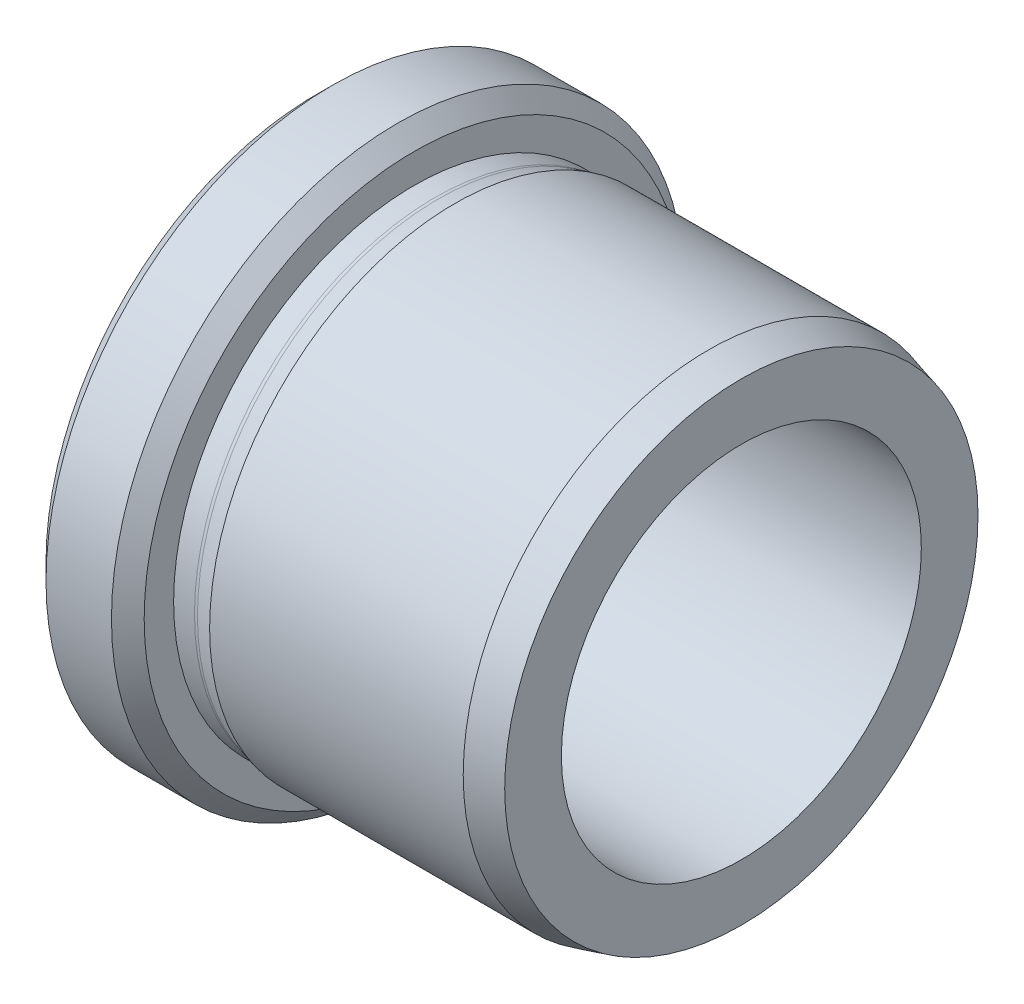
ISO-10303-21;
HEADER;
FILE_DESCRIPTION(('STEP AP214'),'2;1');
FILE_NAME('part.step','',(''),(''),'','','');
FILE_SCHEMA(('AUTOMOTIVE_DESIGN { 1 0 10303 214 1 1 1 1 }'));
ENDSEC;
DATA;
#1=APPLICATION_CONTEXT('core data for automotive mechanical design processes');
#2=APPLICATION_PROTOCOL_DEFINITION('international standard','automotive_design',2000,#1);
#3=PRODUCT_CONTEXT('',#1,'mechanical');
#4=PRODUCT('Part','Part','',(#3));
#5=PRODUCT_RELATED_PRODUCT_CATEGORY('part','',(#4));
#6=PRODUCT_DEFINITION_FORMATION('','',#4);
#7=PRODUCT_DEFINITION_CONTEXT('part definition',#1,'design');
#8=PRODUCT_DEFINITION('design','',#6,#7);
#9=PRODUCT_DEFINITION_SHAPE('','',#8);
#10=(LENGTH_UNIT() NAMED_UNIT(*) SI_UNIT(.MILLI.,.METRE.));
#11=(NAMED_UNIT(*) PLANE_ANGLE_UNIT() SI_UNIT($,.RADIAN.));
#12=(NAMED_UNIT(*) SI_UNIT($,.STERADIAN.) SOLID_ANGLE_UNIT());
#13=UNCERTAINTY_MEASURE_WITH_UNIT(LENGTH_MEASURE(1.E-05),#10,'distance_accuracy_value','');
#14=(GEOMETRIC_REPRESENTATION_CONTEXT(3) GLOBAL_UNCERTAINTY_ASSIGNED_CONTEXT((#13)) GLOBAL_UNIT_ASSIGNED_CONTEXT((#10,
#11,#12)) REPRESENTATION_CONTEXT('',''));
#15=CARTESIAN_POINT('',(0.,0.,0.));
#16=DIRECTION('',(0.,0.,1.));
#17=DIRECTION('',(1.,0.,0.));
#18=AXIS2_PLACEMENT_3D('',#15,#16,#17);
#19=CARTESIAN_POINT('',(18.075539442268,0.,0.));
#20=DIRECTION('',(-1.,0.,0.));
#21=DIRECTION('',(0.,0.,1.));
#22=AXIS2_PLACEMENT_3D('',#19,#20,#21);
#23=TOROIDAL_SURFACE('',#22,15.5,0.8);
#24=CARTESIAN_POINT('',(18.075539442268,0.,0.));
#25=DIRECTION('',(-1.,0.,0.));
#26=DIRECTION('',(0.,0.,1.));
#27=AXIS2_PLACEMENT_3D('',#24,#25,#26);
#28=CIRCLE('',#27,14.7);
#29=CARTESIAN_POINT('',(18.075539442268,0.,14.7));
#30=VERTEX_POINT('',#29);
#31=EDGE_CURVE('E58',#30,#30,#28,.T.);
#32=ORIENTED_EDGE('',*,*,#31,.F.);
#33=EDGE_LOOP('',(#32));
#34=FACE_BOUND('',#33,.T.);
#35=CARTESIAN_POINT('',(18.28259467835,0.,0.));
#36=DIRECTION('',(-1.,0.,0.));
#37=DIRECTION('',(0.,0.,1.));
#38=AXIS2_PLACEMENT_3D('',#35,#36,#37);
#39=CIRCLE('',#38,14.7272593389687);
#40=CARTESIAN_POINT('',(18.28259467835,0.,14.7272593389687));
#41=VERTEX_POINT('',#40);
#42=EDGE_CURVE('E40',#41,#41,#39,.T.);
#43=ORIENTED_EDGE('',*,*,#42,.T.);
#44=EDGE_LOOP('',(#43));
#45=FACE_BOUND('',#44,.T.);
#46=ADVANCED_FACE('F14',(#34,#45),#23,.F.);
#47=CARTESIAN_POINT('',(19.3004766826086,0.,0.));
#48=DIRECTION('',(1.,0.,0.));
#49=DIRECTION('',(0.,0.,-1.));
#50=AXIS2_PLACEMENT_3D('',#47,#48,#49);
#51=CONICAL_SURFACE('',#50,15.,0.261799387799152);
#52=ORIENTED_EDGE('',*,*,#42,.F.);
#53=EDGE_LOOP('',(#52));
#54=FACE_BOUND('',#53,.T.);
#55=CARTESIAN_POINT('',(19.3004766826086,0.,0.));
#56=DIRECTION('',(-1.,0.,0.));
#57=DIRECTION('',(0.,0.,1.));
#58=AXIS2_PLACEMENT_3D('',#55,#56,#57);
#59=CIRCLE('',#58,15.);
#60=CARTESIAN_POINT('',(19.3004766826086,0.,15.));
#61=VERTEX_POINT('',#60);
#62=EDGE_CURVE('E43',#61,#61,#59,.T.);
#63=ORIENTED_EDGE('',*,*,#62,.T.);
#64=EDGE_LOOP('',(#63));
#65=FACE_BOUND('',#64,.T.);
#66=ADVANCED_FACE('F66',(#54,#65),#51,.T.);
#67=CARTESIAN_POINT('',(0.,0.,0.));
#68=DIRECTION('',(-1.,0.,0.));
#69=DIRECTION('',(0.,0.,1.));
#70=AXIS2_PLACEMENT_3D('',#67,#68,#69);
#71=CYLINDRICAL_SURFACE('',#70,15.);
#72=ORIENTED_EDGE('',*,*,#62,.F.);
#73=EDGE_LOOP('',(#72));
#74=FACE_BOUND('',#73,.T.);
#75=CARTESIAN_POINT('',(34.8004766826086,0.,0.));
#76=DIRECTION('',(-1.,0.,0.));
#77=DIRECTION('',(0.,0.,1.));
#78=AXIS2_PLACEMENT_3D('',#75,#76,#77);
#79=CIRCLE('',#78,15.);
#80=CARTESIAN_POINT('',(34.8004766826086,0.,15.));
#81=VERTEX_POINT('',#80);
#82=EDGE_CURVE('E46',#81,#81,#79,.T.);
#83=ORIENTED_EDGE('',*,*,#82,.T.);
#84=EDGE_LOOP('',(#83));
#85=FACE_BOUND('',#84,.T.);
#86=ADVANCED_FACE('F72',(#74,#85),#71,.T.);
#87=CARTESIAN_POINT('',(36.8004766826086,0.,0.));
#88=DIRECTION('',(-1.,0.,0.));
#89=DIRECTION('',(0.,0.,1.));
#90=AXIS2_PLACEMENT_3D('',#87,#88,#89);
#91=CONICAL_SURFACE('',#90,14.4641016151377,0.26179938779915);
#92=ORIENTED_EDGE('',*,*,#82,.F.);
#93=EDGE_LOOP('',(#92));
#94=FACE_BOUND('',#93,.T.);
#95=CARTESIAN_POINT('',(36.8004766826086,0.,0.));
#96=DIRECTION('',(-1.,0.,0.));
#97=DIRECTION('',(0.,0.,1.));
#98=AXIS2_PLACEMENT_3D('',#95,#96,#97);
#99=CIRCLE('',#98,14.4641016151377);
#100=CARTESIAN_POINT('',(36.8004766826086,0.,14.4641016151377));
#101=VERTEX_POINT('',#100);
#102=EDGE_CURVE('E49',#101,#101,#99,.T.);
#103=ORIENTED_EDGE('',*,*,#102,.T.);
#104=EDGE_LOOP('',(#103));
#105=FACE_BOUND('',#104,.T.);
#106=ADVANCED_FACE('F78',(#94,#105),#91,.T.);
#107=CARTESIAN_POINT('',(36.8004766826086,14.4641016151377,0.));
#108=DIRECTION('',(-1.,0.,0.));
#109=DIRECTION('',(0.,0.,1.));
#110=AXIS2_PLACEMENT_3D('',#107,#108,#109);
#111=PLANE('',#110);
#112=ORIENTED_EDGE('',*,*,#102,.F.);
#113=EDGE_LOOP('',(#112));
#114=FACE_BOUND('',#113,.T.);
#115=CARTESIAN_POINT('',(36.8004766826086,0.,0.));
#116=DIRECTION('',(-1.,0.,0.));
#117=DIRECTION('',(0.,0.,1.));
#118=AXIS2_PLACEMENT_3D('',#115,#116,#117);
#119=CIRCLE('',#118,11.);
#120=CARTESIAN_POINT('',(36.8004766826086,0.,11.));
#121=VERTEX_POINT('',#120);
#122=EDGE_CURVE('E52',#121,#121,#119,.T.);
#123=ORIENTED_EDGE('',*,*,#122,.T.);
#124=EDGE_LOOP('',(#123));
#125=FACE_BOUND('',#124,.T.);
#126=ADVANCED_FACE('F84',(#114,#125),#111,.F.);
#127=CARTESIAN_POINT('',(0.,0.,0.));
#128=DIRECTION('',(-1.,0.,0.));
#129=DIRECTION('',(0.,0.,1.));
#130=AXIS2_PLACEMENT_3D('',#127,#128,#129);
#131=CYLINDRICAL_SURFACE('',#130,11.);
#132=CARTESIAN_POINT('',(12.3004766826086,0.,0.));
#133=DIRECTION('',(1.,0.,0.));
#134=DIRECTION('',(0.,0.,-1.));
#135=AXIS2_PLACEMENT_3D('',#132,#133,#134);
#136=CIRCLE('',#135,11.);
#137=CARTESIAN_POINT('',(12.3004766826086,0.,-11.));
#138=VERTEX_POINT('',#137);
#139=EDGE_CURVE('E29',#138,#138,#136,.F.);
#140=ORIENTED_EDGE('',*,*,#139,.T.);
#141=EDGE_LOOP('',(#140));
#142=FACE_BOUND('',#141,.T.);
#143=ORIENTED_EDGE('',*,*,#122,.F.);
#144=EDGE_LOOP('',(#143));
#145=FACE_BOUND('',#144,.T.);
#146=ADVANCED_FACE('F90',(#142,#145),#131,.F.);
#147=CARTESIAN_POINT('',(10.8004766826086,17.5,0.));
#148=DIRECTION('',(1.,0.,0.));
#149=DIRECTION('',(0.,0.,-1.));
#150=AXIS2_PLACEMENT_3D('',#147,#148,#149);
#151=PLANE('',#150);
#152=CARTESIAN_POINT('',(10.8004766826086,0.,0.));
#153=DIRECTION('',(1.,0.,0.));
#154=DIRECTION('',(0.,0.,-1.));
#155=AXIS2_PLACEMENT_3D('',#152,#153,#154);
#156=CIRCLE('',#155,12.5);
#157=CARTESIAN_POINT('',(10.8004766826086,0.,-12.5));
#158=VERTEX_POINT('',#157);
#159=EDGE_CURVE('E25',#158,#158,#156,.T.);
#160=ORIENTED_EDGE('',*,*,#159,.T.);
#161=EDGE_LOOP('',(#160));
#162=FACE_BOUND('',#161,.T.);
#163=CARTESIAN_POINT('',(10.8004766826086,0.,0.));
#164=DIRECTION('',(1.,0.,0.));
#165=DIRECTION('',(0.,0.,-1.));
#166=AXIS2_PLACEMENT_3D('',#163,#164,#165);
#167=CIRCLE('',#166,16.5);
#168=CARTESIAN_POINT('',(10.8004766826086,0.,-16.5));
#169=VERTEX_POINT('',#168);
#170=EDGE_CURVE('E37',#169,#169,#167,.F.);
#171=ORIENTED_EDGE('',*,*,#170,.T.);
#172=EDGE_LOOP('',(#171));
#173=FACE_BOUND('',#172,.T.);
#174=ADVANCED_FACE('F95',(#162,#173),#151,.F.);
#175=CARTESIAN_POINT('',(0.,0.,0.));
#176=DIRECTION('',(-1.,0.,0.));
#177=DIRECTION('',(0.,0.,1.));
#178=AXIS2_PLACEMENT_3D('',#175,#176,#177);
#179=CYLINDRICAL_SURFACE('',#178,17.5);
#180=CARTESIAN_POINT('',(15.8004766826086,0.,0.));
#181=DIRECTION('',(-1.,0.,0.));
#182=DIRECTION('',(0.,0.,1.));
#183=AXIS2_PLACEMENT_3D('',#180,#181,#182);
#184=CIRCLE('',#183,17.5);
#185=CARTESIAN_POINT('',(15.8004766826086,0.,17.5));
#186=VERTEX_POINT('',#185);
#187=EDGE_CURVE('E21',#186,#186,#184,.T.);
#188=ORIENTED_EDGE('',*,*,#187,.T.);
#189=EDGE_LOOP('',(#188));
#190=FACE_BOUND('',#189,.T.);
#191=CARTESIAN_POINT('',(11.8004766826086,0.,0.));
#192=DIRECTION('',(1.,0.,0.));
#193=DIRECTION('',(0.,0.,-1.));
#194=AXIS2_PLACEMENT_3D('',#191,#192,#193);
#195=CIRCLE('',#194,17.5);
#196=CARTESIAN_POINT('',(11.8004766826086,0.,-17.5));
#197=VERTEX_POINT('',#196);
#198=EDGE_CURVE('E34',#197,#197,#195,.T.);
#199=ORIENTED_EDGE('',*,*,#198,.T.);
#200=EDGE_LOOP('',(#199));
#201=FACE_BOUND('',#200,.T.);
#202=ADVANCED_FACE('F103',(#190,#201),#179,.T.);
#203=CARTESIAN_POINT('',(16.8004766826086,17.5,0.));
#204=DIRECTION('',(-1.,0.,0.));
#205=DIRECTION('',(0.,0.,1.));
#206=AXIS2_PLACEMENT_3D('',#203,#204,#205);
#207=PLANE('',#206);
#208=CARTESIAN_POINT('',(16.8004766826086,0.,0.));
#209=DIRECTION('',(-1.,0.,0.));
#210=DIRECTION('',(0.,0.,1.));
#211=AXIS2_PLACEMENT_3D('',#208,#209,#210);
#212=CIRCLE('',#211,16.5);
#213=CARTESIAN_POINT('',(16.8004766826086,0.,16.5));
#214=VERTEX_POINT('',#213);
#215=EDGE_CURVE('E9',#214,#214,#212,.F.);
#216=ORIENTED_EDGE('',*,*,#215,.T.);
#217=EDGE_LOOP('',(#216));
#218=FACE_BOUND('',#217,.T.);
#219=CARTESIAN_POINT('',(16.8004766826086,0.,0.));
#220=DIRECTION('',(-1.,0.,0.));
#221=DIRECTION('',(0.,0.,1.));
#222=AXIS2_PLACEMENT_3D('',#219,#220,#221);
#223=CIRCLE('',#222,14.7);
#224=CARTESIAN_POINT('',(16.8004766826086,0.,14.7));
#225=VERTEX_POINT('',#224);
#226=EDGE_CURVE('E55',#225,#225,#223,.T.);
#227=ORIENTED_EDGE('',*,*,#226,.T.);
#228=EDGE_LOOP('',(#227));
#229=FACE_BOUND('',#228,.T.);
#230=ADVANCED_FACE('F142',(#218,#229),#207,.F.);
#231=CARTESIAN_POINT('',(0.,0.,0.));
#232=DIRECTION('',(-1.,0.,0.));
#233=DIRECTION('',(0.,0.,1.));
#234=AXIS2_PLACEMENT_3D('',#231,#232,#233);
#235=CYLINDRICAL_SURFACE('',#234,14.7);
#236=ORIENTED_EDGE('',*,*,#226,.F.);
#237=EDGE_LOOP('',(#236));
#238=FACE_BOUND('',#237,.T.);
#239=ORIENTED_EDGE('',*,*,#31,.T.);
#240=EDGE_LOOP('',(#239));
#241=FACE_BOUND('',#240,.T.);
#242=ADVANCED_FACE('F62',(#238,#241),#235,.T.);
#243=CARTESIAN_POINT('',(10.8004766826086,0.,0.));
#244=DIRECTION('',(1.,0.,0.));
#245=DIRECTION('',(0.,0.,-1.));
#246=AXIS2_PLACEMENT_3D('',#243,#244,#245);
#247=CONICAL_SURFACE('',#246,16.5,0.785398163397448);
#248=ORIENTED_EDGE('',*,*,#198,.F.);
#249=EDGE_LOOP('',(#248));
#250=FACE_BOUND('',#249,.T.);
#251=ORIENTED_EDGE('',*,*,#170,.F.);
#252=EDGE_LOOP('',(#251));
#253=FACE_BOUND('',#252,.T.);
#254=ADVANCED_FACE('F108',(#250,#253),#247,.T.);
#255=CARTESIAN_POINT('',(12.3004766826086,0.,0.));
#256=DIRECTION('',(1.,0.,0.));
#257=DIRECTION('',(0.,0.,-1.));
#258=AXIS2_PLACEMENT_3D('',#255,#256,#257);
#259=TOROIDAL_SURFACE('',#258,12.5,1.5);
#260=ORIENTED_EDGE('',*,*,#159,.F.);
#261=EDGE_LOOP('',(#260));
#262=FACE_BOUND('',#261,.T.);
#263=ORIENTED_EDGE('',*,*,#139,.F.);
#264=EDGE_LOOP('',(#263));
#265=FACE_BOUND('',#264,.T.);
#266=ADVANCED_FACE('F110',(#262,#265),#259,.T.);
#267=CARTESIAN_POINT('',(15.8004766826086,0.,0.));
#268=DIRECTION('',(-1.,0.,0.));
#269=DIRECTION('',(0.,0.,1.));
#270=AXIS2_PLACEMENT_3D('',#267,#268,#269);
#271=CONICAL_SURFACE('',#270,17.5,0.78539816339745);
#272=ORIENTED_EDGE('',*,*,#215,.F.);
#273=EDGE_LOOP('',(#272));
#274=FACE_BOUND('',#273,.T.);
#275=ORIENTED_EDGE('',*,*,#187,.F.);
#276=EDGE_LOOP('',(#275));
#277=FACE_BOUND('',#276,.T.);
#278=ADVANCED_FACE('F16',(#274,#277),#271,.T.);
#279=CLOSED_SHELL('',(#46,#66,#86,#106,#126,#146,#174,#202,#230,#242,#254,#266,#278));
#280=MANIFOLD_SOLID_BREP('B1',#279);
#281=ADVANCED_BREP_SHAPE_REPRESENTATION('',(#18,#280),#14);
#282=SHAPE_DEFINITION_REPRESENTATION(#9,#281);
ENDSEC;
END-ISO-10303-21;
